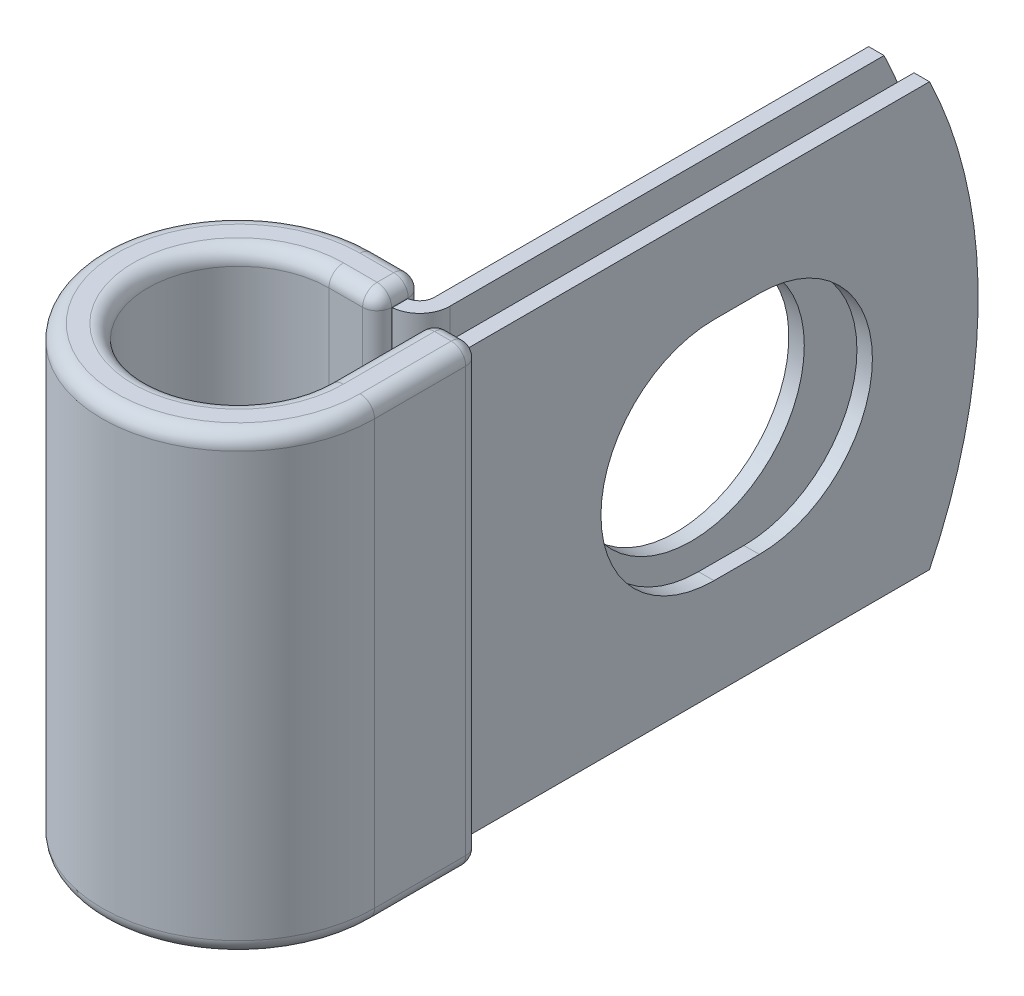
from build123d import *

# Parameters (mm, degrees)
EXTRUDE_THIN1_DEPTH = 11.112499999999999
SKETCH2_R           = 5.9436
CUT_EXTRUDE1_DEPTH  = 0.8128
CUT_EXTRUDE2_REACH  = 38.666
CUT_EXTRUDE3_DEPTH  = 36.681056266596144
FILLET1_R           = 0.762


with BuildPart() as part:
    # Sketch1 → Extrude-Thin1 (new, symmetric)
    with BuildSketch(Plane(origin=(0, 0, 0), x_dir=(1, 0, 0), z_dir=(0, 1, 0))):
        with BuildLine():
            Line((5.5562499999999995, 32.5374), (5.5562499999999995, 5.5562499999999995))
            Line((5.5562499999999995, 5.5562499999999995), (5.5562499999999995, 0))
            ThreePointArc((5.5562499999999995, 0), (-3.928862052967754, -3.9288620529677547), (0, 5.5562499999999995))
            Line((0, 5.5562499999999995), (2.3964900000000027, 5.556249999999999))
            ThreePointArc((2.3964900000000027, 5.556249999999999), (3.5172259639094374, 6.020474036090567), (3.981450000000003, 7.141209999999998))
            Line((3.981450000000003, 7.141209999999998), (3.9814499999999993, 32.5374))
            Line((3.9814499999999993, 32.5374), (3.168649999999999, 32.5374))
            Line((3.168649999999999, 32.5374), (3.1686500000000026, 7.141209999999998))
            ThreePointArc((3.1686500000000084, 7.141210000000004), (2.9424895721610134, 6.595210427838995), (2.396490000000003, 6.369049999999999))
            Line((2.396490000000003, 6.369049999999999), (3e-16, 6.36905))
            ThreePointArc((0, 6.36905), (-4.503598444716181, -4.50359844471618), (6.36905, 3e-17))
            Line((6.36905, 0), (6.36905, 5.5562499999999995))
            Line((6.36905, 5.5562499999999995), (6.36905, 32.5374))
            Line((6.36905, 32.5374), (5.5562499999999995, 32.5374))
        make_face()
    extrude(amount=EXTRUDE_THIN1_DEPTH, both=True)

    # Sketch2 → Cut-Extrude1 (cut)
    with BuildSketch(Plane.ZY.offset(-3.168650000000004)):
        with Locations((-19.837400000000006, 0)):
            Circle(SKETCH2_R)
    extrude(amount=-CUT_EXTRUDE1_DEPTH, mode=Mode.SUBTRACT)

    # Sketch3 → Cut-Extrude2 (cut, up to next)
    with BuildSketch(Plane(origin=(6.36905, 0, 0), x_dir=(0, 0, -1), z_dir=(1, 0, 0)), mode=Mode.PRIVATE) as cut_extrude2_sk1:
        with BuildLine():
            Line((18.643599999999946, 5.943600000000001), (21.03120000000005, 5.943600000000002))
            ThreePointArc((21.03120000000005, 5.943600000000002), (26.974799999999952, 2.64e-15), (21.03120000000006, -5.9436))
            Line((21.03120000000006, -5.9436), (18.643599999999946, -5.943600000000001))
            ThreePointArc((18.643599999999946, -5.943600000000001), (12.699999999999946, 6.2e-16), (18.643599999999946, 5.943600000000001))
        make_face()
    cut_extrude2_tool1 = extrude(cut_extrude2_sk1.sketch, amount=-CUT_EXTRUDE2_REACH, mode=Mode.PRIVATE) & part.part
    add(cut_extrude2_tool1.solids().sort_by_distance((6.36905, 0, -19.8374))[0], mode=Mode.SUBTRACT)

    # Sketch4 → Cut-Extrude3 (cut, through all)
    with BuildSketch(Plane.ZY.offset(-3.168650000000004)):
        with BuildLine():
            Line((-29.977547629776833, 11.112499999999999), (-32.5374, 11.112499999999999))
            Line((-32.5374, 11.112499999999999), (-32.5374, -4.441e-14))
            ThreePointArc((-32.537400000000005, -4.796e-14), (-31.889165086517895, 5.701765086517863), (-29.977547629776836, 11.1125))
        make_face()
        with BuildLine():
            ThreePointArc((-29.977547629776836, -11.112500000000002), (-31.889165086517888, -5.701765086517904), (-32.537400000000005, -4.619e-14))
            Line((-32.5374, -4.441e-14), (-32.5374, -11.112499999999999))
            Line((-32.5374, -11.112499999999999), (-29.977547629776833, -11.112499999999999))
        make_face()
    extrude(amount=-CUT_EXTRUDE3_DEPTH, mode=Mode.SUBTRACT)

    # Sweep1: sweep along a path in Sketch6
    with BuildLine(Plane(origin=(0, 11.112499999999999, 0), x_dir=(1, 0, 0), z_dir=(0, 1, 0))) as sweep1_path:
        Line((4.7625, 5.556249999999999), (4.7625, 0))
        ThreePointArc((4.7625, 0), (-3.3675960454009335, -3.3675960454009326), (0, 4.7625))
        Line((0, 4.7625), (2.533650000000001, 4.762499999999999))
    # Sketch5 → Sweep1 (sweep)
    with BuildSketch(Plane.XY.offset(-5.5562499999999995)):
        with BuildLine():
            Line((4.7624999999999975, -11.144250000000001), (4.7624999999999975, 11.144249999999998))
            ThreePointArc((4.7624999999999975, 11.144249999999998), (4.985684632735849, 11.683065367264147), (5.524499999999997, 11.906249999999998))
            Line((5.524499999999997, 11.906249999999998), (6.4007999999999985, 11.90625))
            ThreePointArc((6.4007999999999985, 11.90625), (6.93961536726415, 11.683065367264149), (7.162799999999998, 11.144249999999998))
            Line((7.162799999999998, 11.144249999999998), (7.1628, -11.144250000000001))
            ThreePointArc((7.1628, -11.144250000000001), (6.93961536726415, -11.683065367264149), (6.400800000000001, -11.90625))
            Line((6.400800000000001, -11.90625), (5.524499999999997, -11.90625))
            ThreePointArc((5.524499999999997, -11.90625), (4.985684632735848, -11.68306536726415), (4.7624999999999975, -11.144250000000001))
        make_face()
        Polygon((5.556249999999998, 11.112499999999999), (6.369049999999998, 11.112499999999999), (6.3690500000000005, -11.112499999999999), (5.556249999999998, -11.1125), align=None, mode=Mode.SUBTRACT)
    sweep(path=sweep1_path.line)

    # Fillet1
    fillet1_edges = [part.edges().sort_by_distance(p)[0] for p in [
        (2.53365, -11.683065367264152, -4.985684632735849),
        (2.5336499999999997, -11.906249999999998, -5.962650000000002),
        (2.5336499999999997, -11.683065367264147, -6.9396153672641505),
        (2.5336499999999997, -1.78e-15, -7.162800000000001),
        (2.5336499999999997, 11.683065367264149, -6.939615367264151),
        (2.53365, 11.90625, -5.96265),
        (2.53365, 11.683065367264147, -4.98568463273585),
        (2.53365, -1.78e-15, -4.762499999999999),
        (4.985684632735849, -11.683065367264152, -5.5562499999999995),
        (5.962650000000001, -11.906249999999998, -5.5562499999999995),
        (6.9396153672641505, -11.683065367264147, -5.5562499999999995),
        (7.162800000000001, -1.78e-15, -5.5562499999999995),
        (6.939615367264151, 11.683065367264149, -5.5562499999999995),
        (5.96265, 11.90625, -5.5562499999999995),
        (4.98568463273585, 11.683065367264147, -5.5562499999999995),
        (4.762499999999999, -1.78e-15, -5.5562499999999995),
    ]]
    fillet(fillet1_edges, radius=FILLET1_R)


solid = part.part
